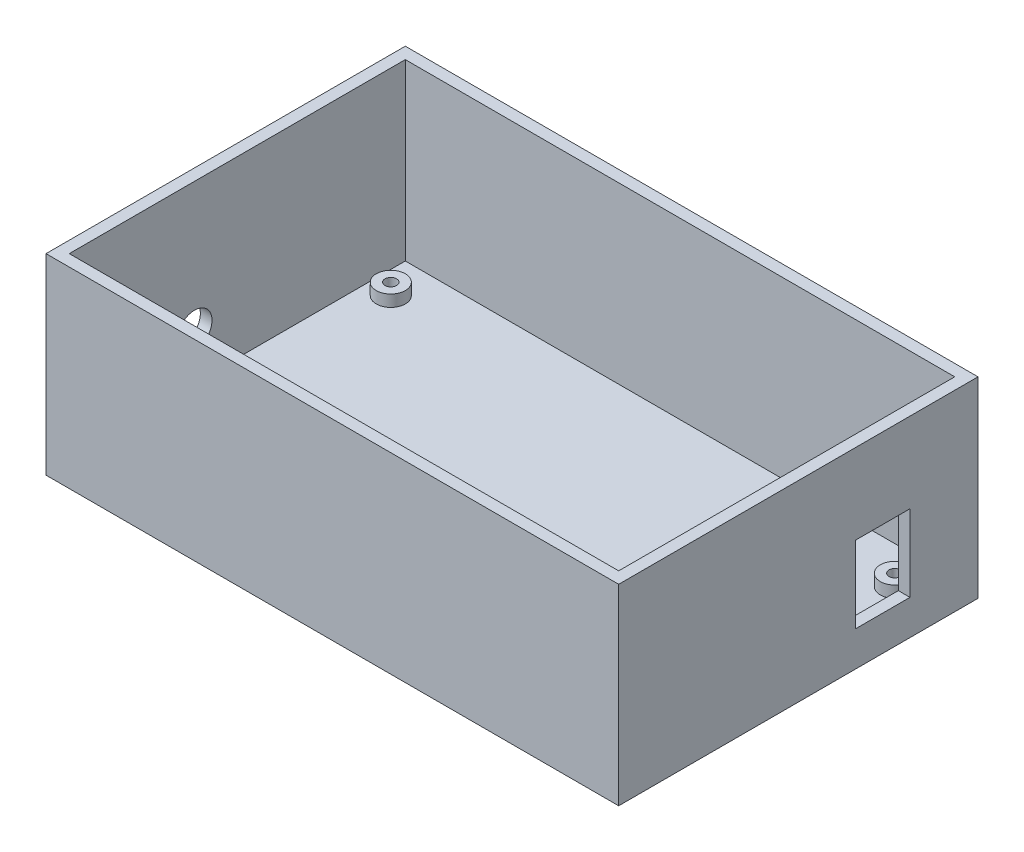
from build123d import *

# Parameters (mm, degrees)
SKETCH1_W           = 98.5
SKETCH1_H           = 61.8
BOSS_EXTRUDE1_DEPTH = 3
SKETCH2_R           = 2.5
BOSS_EXTRUDE2_DEPTH = 2
SKETCH3_W           = 98.5
SKETCH3_H           = 61.8
SKETCH3_W_2         = 94.5
SKETCH3_H_2         = 57.8
BOSS_EXTRUDE3_DEPTH = 30
SKETCH4_W           = 9.4
SKETCH4_H           = 13.2
CUT_EXTRUDE1_DEPTH  = 2
SKETCH5_R           = 1
CUT_EXTRUDE2_DEPTH  = 3
SKETCH6_R           = 3
CUT_EXTRUDE3_DEPTH  = 6.6


with BuildPart() as part:
    # Sketch1 → Boss-Extrude1 (new body)
    with BuildSketch(Plane(origin=(0, -5, 0), x_dir=(-1, 0, 0), z_dir=(0, -1, 0))):
        with Locations((0, 0.05)):
            Rectangle(SKETCH1_W, SKETCH1_H)
    extrude(amount=-BOSS_EXTRUDE1_DEPTH)

    # Sketch2 → Boss-Extrude2 (add)
    with BuildSketch(Plane(origin=(0, -2, 0), x_dir=(1, 0, 0), z_dir=(0, 1, 0))):
        with Locations(Location((-43.35, 22.55, 0), (0, 0, 90))):
            Circle(SKETCH2_R)
        with Locations(Location((-43.35, -22.55, 0), (0, 0, 90))):
            Circle(SKETCH2_R)
        with Locations(Location((43.35, -22.55, 0), (0, 0, 90))):
            Circle(SKETCH2_R)
        with Locations(Location((43.35, 22.55, 0), (0, 0, 90))):
            Circle(SKETCH2_R)
    extrude(amount=BOSS_EXTRUDE2_DEPTH)

    # Sketch3 → Boss-Extrude3 (add)
    with BuildSketch(Plane(origin=(0, -2, 0), x_dir=(1, 0, 0), z_dir=(0, 1, 0))):
        with Locations((0, 0.05)):
            Rectangle(SKETCH3_W, SKETCH3_H)
        with Locations((0, 0.05)):
            Rectangle(SKETCH3_W_2, SKETCH3_H_2, mode=Mode.SUBTRACT)
    extrude(amount=BOSS_EXTRUDE3_DEPTH)

    # Sketch4 → Cut-Extrude1 (cut)
    with BuildSketch(Plane(origin=(49.25, 0, 0), x_dir=(0, 0, -1), z_dir=(1, 0, 0))):
        with Locations((14.55, 7.6)):
            Rectangle(SKETCH4_W, SKETCH4_H)
    extrude(amount=-CUT_EXTRUDE1_DEPTH, mode=Mode.SUBTRACT)

    # Sketch5 → Cut-Extrude2 (cut)
    with BuildSketch(Plane(origin=(0, 0, 0), x_dir=(1, 0, 0), z_dir=(0, 1, 0))):
        with Locations(Location((43.35, 22.55, 0), (0, 0, 270))):
            Circle(SKETCH5_R)
        with Locations(Location((43.35, -22.55, 0), (0, 0, 270))):
            Circle(SKETCH5_R)
        with Locations(Location((-43.35, -22.55, 0), (0, 0, 270))):
            Circle(SKETCH5_R)
        with Locations(Location((-43.35, 22.55, 0), (0, 0, 270))):
            Circle(SKETCH5_R)
    extrude(amount=-CUT_EXTRUDE2_DEPTH, mode=Mode.SUBTRACT)

    # Sketch6 → Cut-Extrude3 (cut)
    with BuildSketch(Plane.ZY.offset(49.25)):
        with Locations((7.3, 5.8)):
            Circle(SKETCH6_R)
    extrude(amount=-CUT_EXTRUDE3_DEPTH, mode=Mode.SUBTRACT)


solid = part.part
